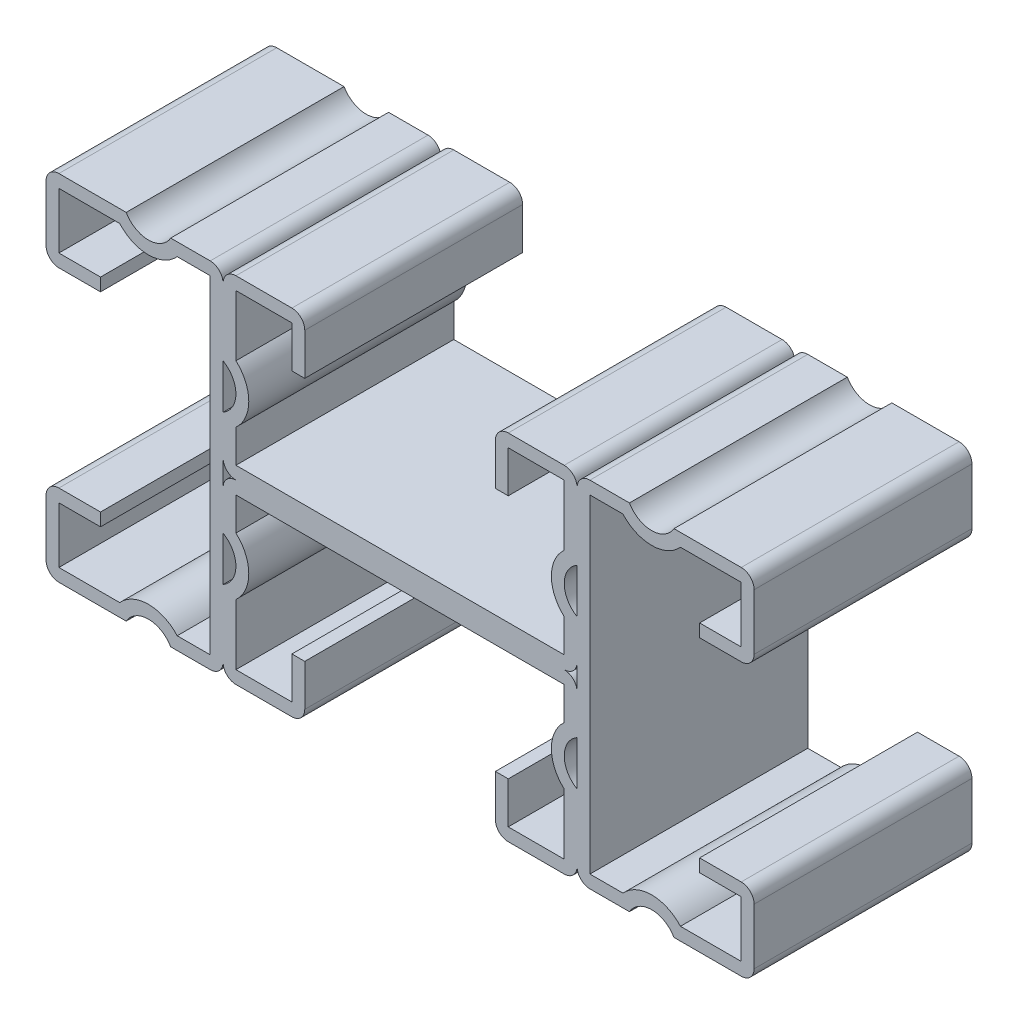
from build123d import *

# Parameters (mm, degrees)
BASE_EXTRUDE_DEPTH  = 12.7
BOSS_EXTRUDE1_DEPTH = 12.7


with BuildPart() as part:
    # Sketch1 → Base-Extrude (new, symmetric)
    with BuildSketch(Plane.XY):
        with BuildLine():
            Line((-20.6375, 19.1389), (-20.6375, 11.29515134))
            ThreePointArc((-20.6375, 11.29515134), (-19.1389, 8.6995), (-20.6375, 6.10384866))
            Line((-20.6375, 6.10384866), (-20.6375, 1.4986))
            ThreePointArc((-20.6375, 1.4986), (-20.198570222, 0.438929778), (-19.1389, 0))
            Line((-19.1389, 0), (19.1389, 0))
            ThreePointArc((19.1389, 0), (20.198570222, 0.438929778), (20.6375, 1.4986))
            Line((20.6375, 1.4986), (20.6375, 6.10384866))
            ThreePointArc((20.6375, 6.10384866), (19.1389, 8.6995), (20.6375, 11.29515134))
            Line((20.6375, 11.29515134), (20.6375, 19.1389))
            ThreePointArc((20.6375, 19.1389), (20.198570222, 20.198570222), (19.1389, 20.6375))
            Line((19.1389, 20.6375), (12.6111, 20.6375))
            ThreePointArc((12.6111, 20.6375), (11.551429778, 20.198570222), (11.1125, 19.1389))
            Line((11.1125, 19.1389), (11.1125, 14.2875))
            Line((11.1125, 14.2875), (12.6111, 14.2875))
            Line((12.6111, 14.2875), (12.6111, 19.1389))
            Line((12.6111, 19.1389), (19.1389, 19.1389))
            Line((19.1389, 19.1389), (19.1389, 12.050471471))
            ThreePointArc((19.1389, 12.050471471), (17.6403, 8.6995), (19.1389, 5.348528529))
            Line((19.1389, 5.348528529), (19.1389, 1.4986))
            Line((19.1389, 1.4986), (-19.1389, 1.4986))
            Line((-19.1389, 1.4986), (-19.1389, 5.348528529))
            ThreePointArc((-19.1389, 5.348528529), (-17.6403, 8.6995), (-19.1389, 12.050471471))
            Line((-19.1389, 12.050471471), (-19.1389, 19.1389))
            Line((-19.1389, 19.1389), (-12.6111, 19.1389))
            Line((-12.6111, 19.1389), (-12.6111, 14.2875))
            Line((-12.6111, 14.2875), (-11.1125, 14.2875))
            Line((-11.1125, 14.2875), (-11.1125, 19.1389))
            ThreePointArc((-11.1125, 19.1389), (-11.551429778, 20.198570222), (-12.6111, 20.6375))
            Line((-12.6111, 20.6375), (-19.1389, 20.6375))
            ThreePointArc((-19.1389, 20.6375), (-20.198570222, 20.198570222), (-20.6375, 19.1389))
        make_face()
    base_extrude = extrude(amount=BASE_EXTRUDE_DEPTH, both=True)

    # Mirror1: Base-Extrude across plane
    add(base_extrude.mirror(Plane.ZX))

    # Sketch2 → Boss-Extrude1 (add, symmetric)
    with BuildSketch(Plane(origin=(20.16125, 0.15875, 0), x_dir=(0, -1, 0), z_dir=(0, 0, 1))):
        with BuildLine():
            Line((-20.47875, 19.61515), (-20.47875, 11.77140134))
            ThreePointArc((-20.47875, 11.77140134), (-18.98015, 9.17575), (-20.47875, 6.58009866))
            Line((-20.47875, 6.58009866), (-20.47875, 1.97485))
            ThreePointArc((-20.47875, 1.97485), (-20.039820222, 0.915179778), (-18.98015, 0.47625))
            Line((-18.98015, 0.47625), (19.29765, 0.47625))
            ThreePointArc((19.29765, 0.47625), (20.357320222, 0.915179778), (20.79625, 1.97485))
            Line((20.79625, 1.97485), (20.79625, 6.58009866))
            ThreePointArc((20.79625, 6.58009866), (19.29765, 9.17575), (20.79625, 11.77140134))
            Line((20.79625, 11.77140134), (20.79625, 19.61515))
            ThreePointArc((20.79625, 19.61515), (20.357320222, 20.674820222), (19.29765, 21.11375))
            Line((19.29765, 21.11375), (12.76985, 21.11375))
            ThreePointArc((12.76985, 21.11375), (11.710179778, 20.674820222), (11.27125, 19.61515))
            Line((11.27125, 19.61515), (11.27125, 14.76375))
            Line((11.27125, 14.76375), (12.76985, 14.76375))
            Line((12.76985, 14.76375), (12.76985, 19.61515))
            Line((12.76985, 19.61515), (19.29765, 19.61515))
            Line((19.29765, 19.61515), (19.29765, 12.526721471))
            ThreePointArc((19.29765, 12.526721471), (17.79905, 9.17575), (19.29765, 5.824778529))
            Line((19.29765, 5.824778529), (19.29765, 1.97485))
            Line((19.29765, 1.97485), (-18.98015, 1.97485))
            Line((-18.98015, 1.97485), (-18.98015, 5.824778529))
            ThreePointArc((-18.98015, 5.824778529), (-17.48155, 9.17575), (-18.98015, 12.526721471))
            Line((-18.98015, 12.526721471), (-18.98015, 19.61515))
            Line((-18.98015, 19.61515), (-12.45235, 19.61515))
            Line((-12.45235, 19.61515), (-12.45235, 14.76375))
            Line((-12.45235, 14.76375), (-10.95375, 14.76375))
            Line((-10.95375, 14.76375), (-10.95375, 19.61515))
            ThreePointArc((-10.95375, 19.61515), (-11.392679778, 20.674820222), (-12.45235, 21.11375))
            Line((-12.45235, 21.11375), (-18.98015, 21.11375))
            ThreePointArc((-18.98015, 21.11375), (-20.039820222, 20.674820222), (-20.47875, 19.61515))
        make_face()
    boss_extrude1 = extrude(amount=BOSS_EXTRUDE1_DEPTH, both=True)

    # Mirror2: Boss-Extrude1 across plane
    add(boss_extrude1.mirror(Plane(origin=(0, 0, 0), x_dir=(0, 0, 1), z_dir=(1, 0, 0))))


solid = part.part
